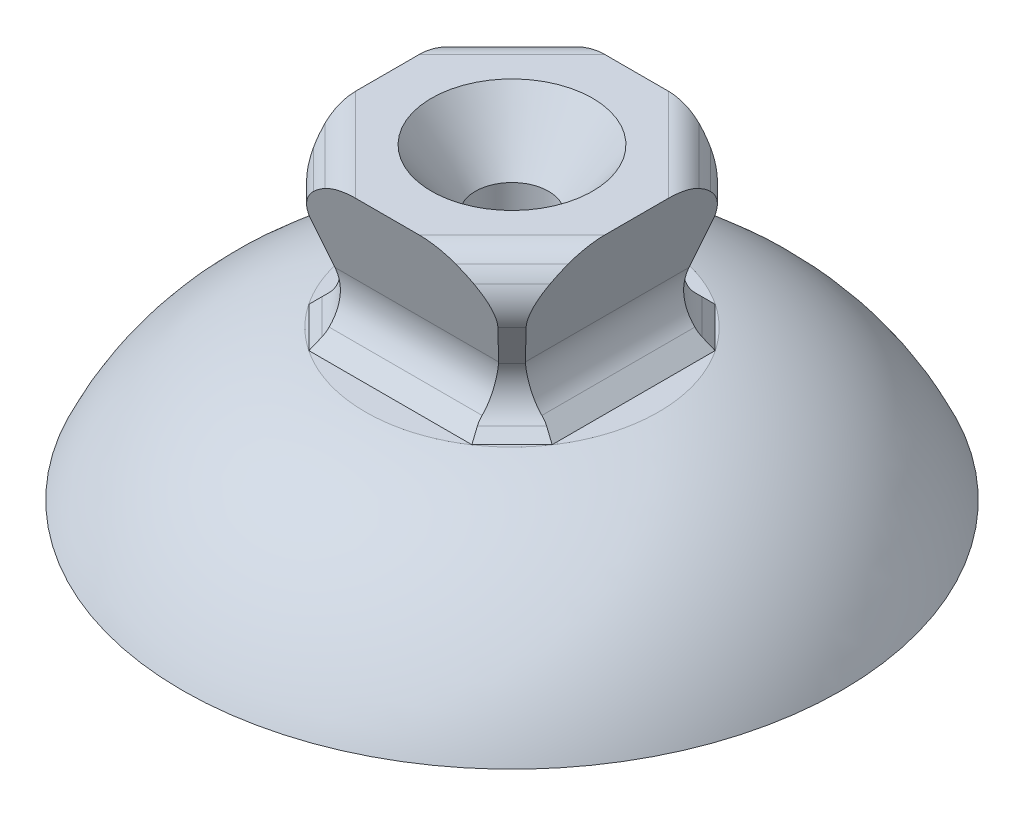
from build123d import *

# Parameters (mm, degrees)
SKETCH4_W           = 17
SKETCH4_H           = 11
BOSS_EXTRUDE2_DEPTH = 8.5
CUT_EXTRUDE1_DEPTH  = 13.5
CUT_EXTRUDE2_DEPTH  = 13.5
CUT_EXTRUDE3_DEPTH  = 13.5
CUT_EXTRUDE4_DEPTH  = 13.5
FILLET1_R           = 2


with BuildPart() as part:
    # Sketch4 → Boss-Extrude2 (new, symmetric)
    with BuildSketch(Plane.XY):
        Rectangle(SKETCH4_W, SKETCH4_H)
    extrude(amount=BOSS_EXTRUDE2_DEPTH, both=True)

    # Sketch5 → Cut-Extrude1 (cut, symmetric)
    with BuildSketch(Plane(origin=(0, 0, 0), x_dir=(0, 0, -1), z_dir=(1, 0, 0))):
        with BuildLine():
            Line((8.5, 5.5), (6.502509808, -1.291466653))
            ThreePointArc((6.502509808, -1.291466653), (6.473626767, -2.879228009), (7.259285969, -4.259285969))
            Line((7.259285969, -4.259285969), (8.5, -5.5))
            Line((8.5, -5.5), (8.5, 5.5))
        make_face()
        with BuildLine():
            Line((-8.5, -5.5), (-7.259285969, -4.259285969))
            ThreePointArc((-7.259285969, -4.259285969), (-6.473626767, -2.879228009), (-6.502509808, -1.291466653))
            Line((-6.502509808, -1.291466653), (-8.5, 5.5))
            Line((-8.5, 5.5), (-8.5, -5.5))
        make_face()
    extrude(amount=CUT_EXTRUDE1_DEPTH, both=True, mode=Mode.SUBTRACT)

    # Sketch7 → Cut-Extrude2 (cut, symmetric)
    with BuildSketch(Plane.XY):
        with BuildLine():
            Line((8.5, 5.5), (6.502538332, -1.291517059))
            ThreePointArc((6.502538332, -1.291517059), (6.473662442, -2.879270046), (7.259319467, -4.259319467))
            Line((7.259319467, -4.259319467), (8.5, -5.5))
            Line((8.5, -5.5), (8.5, 5.5))
        make_face()
        with BuildLine():
            Line((-8.5, -5.5), (-7.259319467, -4.259319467))
            ThreePointArc((-7.259319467, -4.259319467), (-6.473662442, -2.879270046), (-6.502538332, -1.291517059))
            Line((-6.502538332, -1.291517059), (-8.5, 5.5))
            Line((-8.5, 5.5), (-8.5, -5.5))
        make_face()
    extrude(amount=CUT_EXTRUDE2_DEPTH, both=True, mode=Mode.SUBTRACT)

    # Sketch11 → Cut-Extrude3 (cut, symmetric)
    with BuildSketch(Plane(origin=(0, 0, 0), x_dir=(0.7071067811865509, 0, -0.7071067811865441), z_dir=(0.7071067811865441, 0, 0.7071067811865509))):
        with BuildLine():
            Line((10, -5.5), (9.159523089, -4.659523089))
            ThreePointArc((9.159523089, -4.659523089), (8.341069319, -3.136306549), (8.499291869, -1.414382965))
            Line((8.499291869, -1.414382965), (9.693462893, 1.541294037))
            ThreePointArc((9.693462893, 1.541294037), (9.908907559, 2.799328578), (9.581873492, 4.033069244))
            ThreePointArc((9.581873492, 4.033069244), (9.013209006, 4.854851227), (8.25, 5.5))
            Line((8.25, 5.5), (14, 5.5))
            Line((14, 5.5), (14, -5.5))
            Line((14, -5.5), (10, -5.5))
        make_face()
        with BuildLine():
            Line((-14, 5.5), (-8.25, 5.5))
            ThreePointArc((-8.25, 5.5), (-9.013209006, 4.854851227), (-9.581873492, 4.033069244))
            ThreePointArc((-9.581873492, 4.033069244), (-9.908907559, 2.799328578), (-9.693462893, 1.541294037))
            Line((-9.693462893, 1.541294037), (-8.499291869, -1.414382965))
            ThreePointArc((-8.499291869, -1.414382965), (-8.341069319, -3.136306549), (-9.159523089, -4.659523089))
            Line((-9.159523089, -4.659523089), (-10, -5.5))
            Line((-10, -5.5), (-14, -5.5))
            Line((-14, -5.5), (-14, 5.5))
        make_face()
    extrude(amount=CUT_EXTRUDE3_DEPTH, both=True, mode=Mode.SUBTRACT)

    # Sketch12 → Cut-Extrude4 (cut, symmetric)
    with BuildSketch(Plane(origin=(0, 0, 0), x_dir=(-0.7071067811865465, 0, -0.7071067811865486), z_dir=(0.7071067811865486, 0, -0.7071067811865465))):
        with BuildLine():
            Line((10, -5.5), (9.159523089, -4.659523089))
            ThreePointArc((9.159523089, -4.659523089), (8.341069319, -3.136306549), (8.499291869, -1.414382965))
            Line((8.499291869, -1.414382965), (9.693462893, 1.541294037))
            ThreePointArc((9.693462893, 1.541294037), (9.908907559, 2.799328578), (9.581873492, 4.033069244))
            ThreePointArc((9.581873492, 4.033069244), (9.013209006, 4.854851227), (8.25, 5.5))
            Line((8.25, 5.5), (14, 5.5))
            Line((14, 5.5), (14, -5.5))
            Line((14, -5.5), (10, -5.5))
        make_face()
        with BuildLine():
            Line((-14, 5.5), (-8.25, 5.5))
            ThreePointArc((-8.25, 5.5), (-9.013209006, 4.854851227), (-9.581873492, 4.033069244))
            ThreePointArc((-9.581873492, 4.033069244), (-9.908907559, 2.799328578), (-9.693462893, 1.541294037))
            Line((-9.693462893, 1.541294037), (-8.499291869, -1.414382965))
            ThreePointArc((-8.499291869, -1.414382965), (-8.341069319, -3.136306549), (-9.159523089, -4.659523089))
            Line((-9.159523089, -4.659523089), (-10, -5.5))
            Line((-10, -5.5), (-14, -5.5))
            Line((-14, -5.5), (-14, 5.5))
        make_face()
    extrude(amount=CUT_EXTRUDE4_DEPTH, both=True, mode=Mode.SUBTRACT)

    # Sketch14 → Cut-Revolve1 (revolve, cut)
    with BuildSketch(Plane.XY, mode=Mode.PRIVATE) as cut_revolve1_sk:
        Polygon((0, 5.5), (5.5, 5.5), (2.5, 1.5), (2.5, -5.5), (0, -5.5), align=None)
    revolve(cut_revolve1_sk.sketch.rotate(Axis((0, -5.5, 0), (0, 1, 0)), 90), axis=Axis((0, -5.5, 0), (0, 1, 0)), mode=Mode.SUBTRACT)

    # Fillet1
    fillet1_edges = [part.edges().sort_by_distance(p)[0] for p in [
        (5.833630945, 5.5, -5.833630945),
        (-5.833630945, 5.5, -5.833630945),
        (-5.833630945, 5.5, 5.833630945),
        (5.833630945, 5.5, 5.833630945),
    ]]
    fillet(fillet1_edges, radius=FILLET1_R)

    # Sketch15 → Revolve1 (revolve)
    with BuildSketch(Plane(origin=(0, 0, 0), x_dir=(0, 0, -1), z_dir=(1, 0, 0))):
        with BuildLine():
            Line((0, -15.5), (22.5, -15.5))
            ThreePointArc((22.5, -15.5), (17.455904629, -8.920713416), (9.9979998, -5.3))
            Line((9.9979998, -5.3), (0, -5.3))
            Line((0, -5.3), (0, -5.5))
            Line((0, -5.5), (0, -15.5))
        make_face()
    revolve(axis=Axis((0, -5.5, 0), (0, -1, 0)))


solid = part.part
